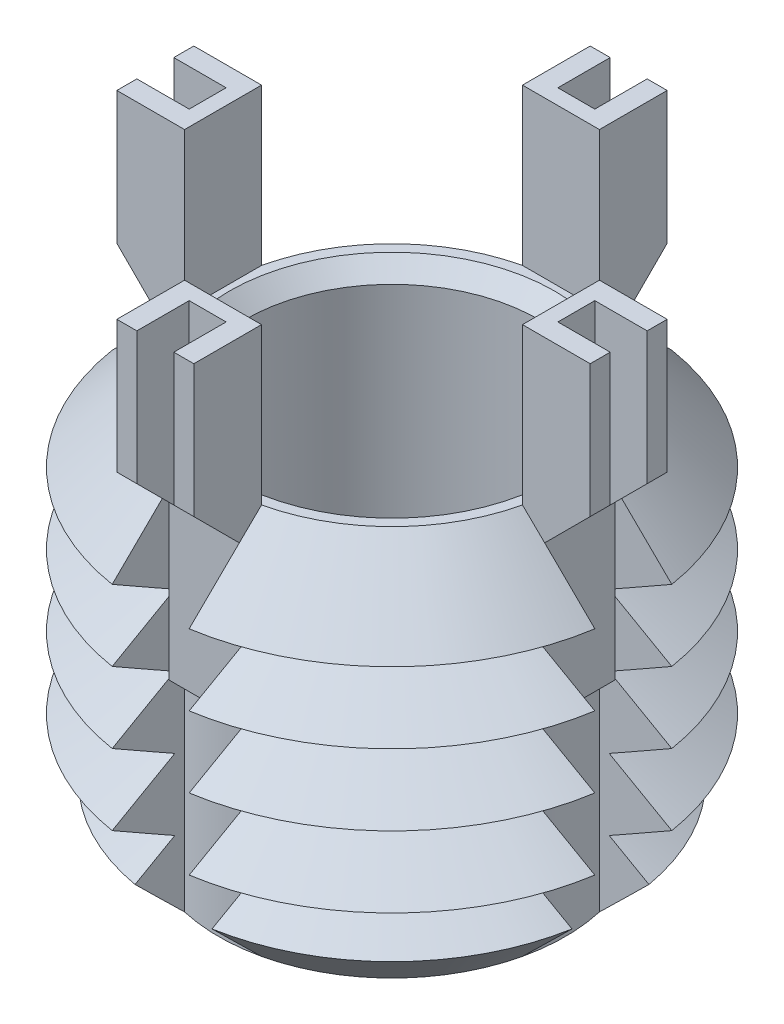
from build123d import *

# Parameters (mm, degrees)
SKETCH1_R               = 7.9375
BOSS_EXTRUDE1_DEPTH     = 12.7
CHAMFER1_SIZE           = 2.309
LPATTERN1_COUNT         = 4
LPATTERN1_PITCH         = 2.309
CUT_EXTRUDE1_REACH      = 18.95
CIRPATTERN1_COUNT       = 4
BOSS_EXTRUDE3_DEPTH     = 1.25
CIRPATTERN2_COUNT       = 4
CUT_EXTRUDE3_DEPTH      = 21.946654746
CUT_EXTRUDE3_DEPTH_BACK = 21.946654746
SKETCH6_W               = 1.7
SKETCH6_H               = 1.2
SKETCH6_W_2             = 1.2
SKETCH6_H_2             = 1.7
SKETCH7_R               = 4.7625
CUT_EXTRUDE4_DEPTH      = 12.7
CHAMFER2_SIZE           = 0.529


with BuildPart() as part:
    # Sketch1 → Boss-Extrude1 (new body)
    with BuildSketch(Plane(origin=(0, 0, 0), x_dir=(1, 0, 0), z_dir=(0, 1, 0))):
        with Locations(Location((0, 0, 0), (0, 0, 270))):
            Circle(SKETCH1_R)
    extrude(amount=-BOSS_EXTRUDE1_DEPTH)

    # Chamfer1
    chamfer1_edges = [part.edges().sort_by_distance(p)[0] for p in [
        (0, 0, -7.9375),
        (0, -12.7, -7.9375),
    ]]
    chamfer(chamfer1_edges, length=CHAMFER1_SIZE)

    # Sketch3 → Cut-Revolve1 (revolve, cut)
    with BuildSketch(Plane(origin=(0, 0, 0), x_dir=(0, 0, -1), z_dir=(1, 0, 0))):
        Polygon((-7.9375, -2.309), (-5.937847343, -3.4635), (-7.9375, -4.618), align=None)
    cut_revolve1 = revolve(axis=Axis((0, 0.885892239, 0), (0, -1, 0)), mode=Mode.SUBTRACT)

    # LPattern1: Cut-Revolve1 ×4
    with Locations(*[(0, -i * LPATTERN1_PITCH, 0) for i in range(1, LPATTERN1_COUNT)]):
        add(cut_revolve1, mode=Mode.SUBTRACT)

    # Cut-Extrude1: up to this cone (the profile starts inside it)
    cut_extrude1_end = Plane(origin=(0, 0, 0), z_dir=(0, 1, 0)).offset(-18.328499) * Cone(1e-06, 56.107, 56.106999, align=(Align.CENTER, Align.CENTER, Align.MIN), mode=Mode.PRIVATE)
    # Sketch4 → Cut-Extrude1 (cut, up to the surface)
    with BuildSketch(Plane(origin=(0, 0, 0), x_dir=(1, 0, 0), z_dir=(0, 1, 0)), mode=Mode.PRIVATE) as cut_extrude1_sk1:
        with BuildLine():
            Line((-5.487942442, 1.25), (-7.838456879, 1.25))
            ThreePointArc((-7.838456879, 1.25), (-7.9375, 0), (-7.838456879, -1.25))
            Line((-7.838456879, -1.25), (-5.487942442, -1.25))
            ThreePointArc((-5.487942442, -1.25), (-5.6285, 0), (-5.487942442, 1.25))
        make_face()
    cut_extrude1_tool1 = extrude(cut_extrude1_sk1.sketch, amount=-CUT_EXTRUDE1_REACH, mode=Mode.PRIVATE) & cut_extrude1_end
    cut_extrude1 = cut_extrude1_tool1.solids().sort_by_distance((-6.743037, 0, 0))[0]
    add(cut_extrude1, mode=Mode.SUBTRACT)

    # CirPattern1: Cut-Extrude1 ×4 about axis
    cirpattern1_axis = Axis((0, 0, 0), (0, 1, 0))
    for i in range(1, CIRPATTERN1_COUNT):
        add(cut_extrude1.rotate(cirpattern1_axis, i * 360 / CIRPATTERN1_COUNT), mode=Mode.SUBTRACT)

    # Sketch5 → Boss-Extrude3 (add, symmetric)
    with BuildSketch(Plane(origin=(0, 0, 0), x_dir=(0, 0, -1), z_dir=(1, 0, 0))):
        Polygon((-5.487942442, 5.073), (-5.487942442, -5.927), (-5.987942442, -5.927), (-5.987942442, -0.927), (-7.687942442, 0.773), (-7.687942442, 5.073), align=None)
    boss_extrude3 = extrude(amount=BOSS_EXTRUDE3_DEPTH, both=True)

    # CirPattern2: Boss-Extrude3 ×4 about axis
    cirpattern2_axis = Axis((0, 0, 0), (0, 1, 0))
    for i in range(1, CIRPATTERN2_COUNT):
        add(boss_extrude3.rotate(cirpattern2_axis, i * 360 / CIRPATTERN2_COUNT))

    # Sketch6 → Cut-Extrude3 (cut, two sides: drawn at the far end of the back side and taken through both)
    with BuildSketch(Plane(origin=(0, 5.073, 0), x_dir=(1, 0, 0), z_dir=(0, 1, 0)).offset(-CUT_EXTRUDE3_DEPTH_BACK)):
        with Locations((-6.837942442, 0)):
            Rectangle(SKETCH6_W, SKETCH6_H)
        with Locations((0, 6.837942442)):
            Rectangle(SKETCH6_W_2, SKETCH6_H_2)
        with Locations((6.837942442, 0)):
            Rectangle(SKETCH6_W, SKETCH6_H)
        with Locations((0, -6.837942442)):
            Rectangle(SKETCH6_W_2, SKETCH6_H_2)
    extrude(amount=CUT_EXTRUDE3_DEPTH + CUT_EXTRUDE3_DEPTH_BACK, mode=Mode.SUBTRACT)

    # Sketch7 → Cut-Extrude4 (cut)
    with BuildSketch(Plane(origin=(0, 0, 0), x_dir=(1, 0, 0), z_dir=(0, 1, 0))):
        with Locations(Location((0, 0, 0), (0, 0, 270))):
            Circle(SKETCH7_R)
    extrude(amount=-CUT_EXTRUDE4_DEPTH, mode=Mode.SUBTRACT)

    # Chamfer2
    chamfer2_edges = [part.edges().sort_by_distance(p)[0] for p in [
        (0, 0, -4.7625),
        (0, -12.7, -4.7625),
    ]]
    chamfer(chamfer2_edges, length=CHAMFER2_SIZE)


solid = part.part
